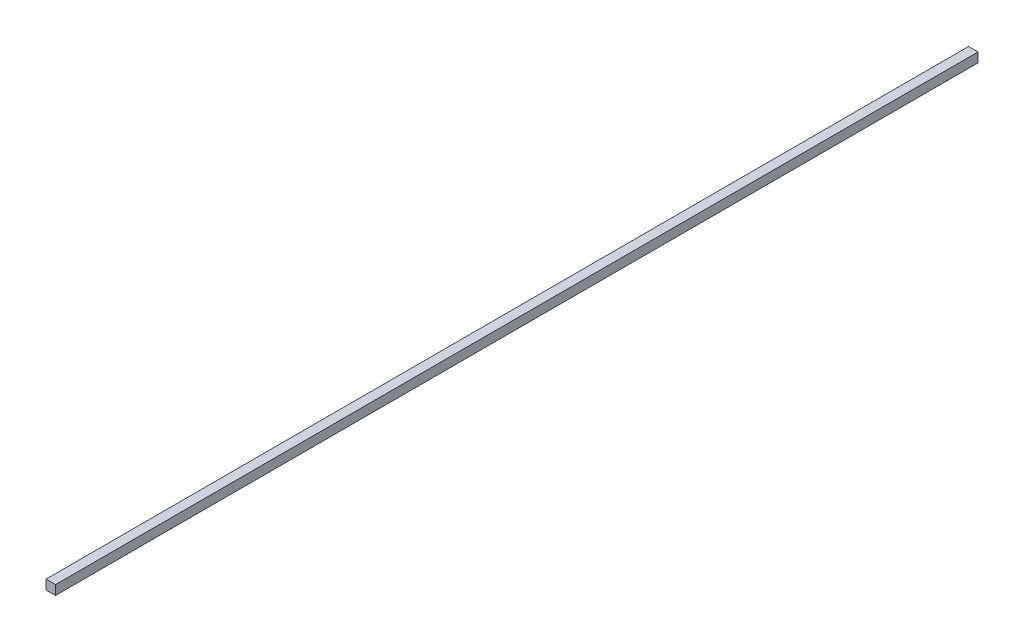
from build123d import *

# Parameters (mm, degrees)
ESQUISSE1_W      = 2
ESQUISSE1_H      = 2
EXTRUSION1_DEPTH = 97.5


with BuildPart() as part:
    # Esquisse1 → Extrusion1 (new, symmetric)
    with BuildSketch(Plane.XY):
        Rectangle(ESQUISSE1_W, ESQUISSE1_H)
    extrude(amount=EXTRUSION1_DEPTH, both=True)


solid = part.part
